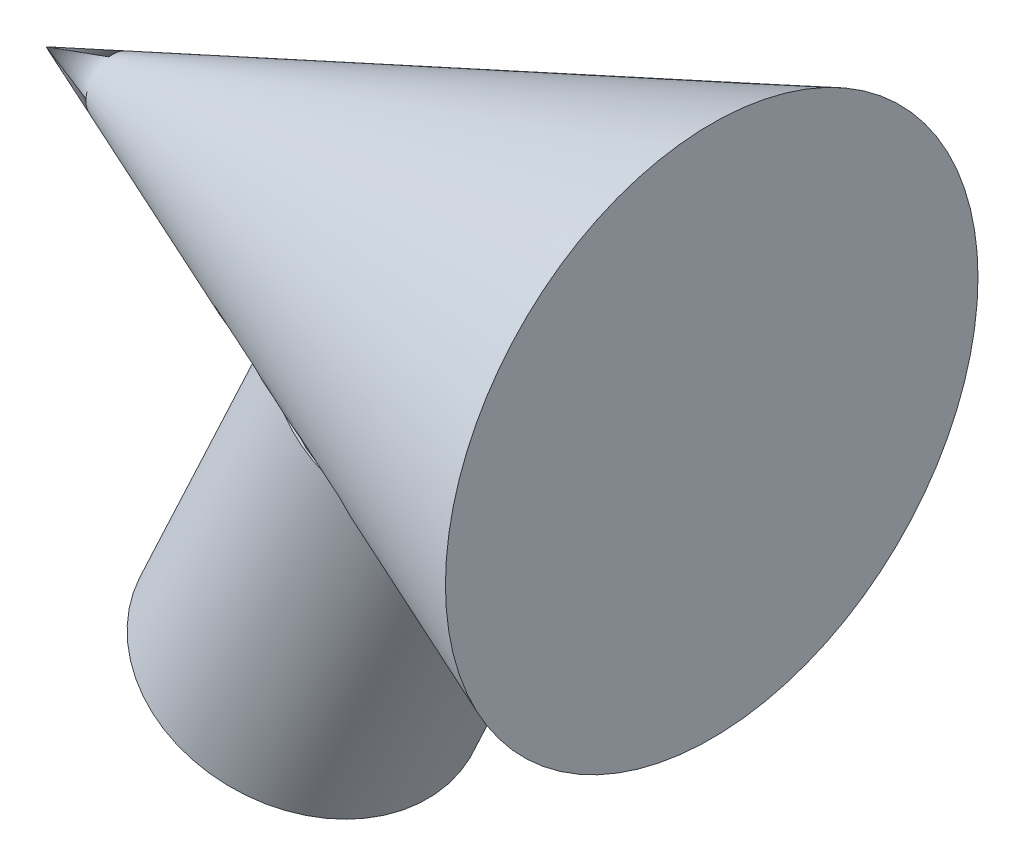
ISO-10303-21;
HEADER;
FILE_DESCRIPTION(('STEP AP214'),'2;1');
FILE_NAME('part.step','',(''),(''),'','','');
FILE_SCHEMA(('AUTOMOTIVE_DESIGN { 1 0 10303 214 1 1 1 1 }'));
ENDSEC;
DATA;
#1=APPLICATION_CONTEXT('core data for automotive mechanical design processes');
#2=APPLICATION_PROTOCOL_DEFINITION('international standard','automotive_design',2000,#1);
#3=PRODUCT_CONTEXT('',#1,'mechanical');
#4=PRODUCT('Part','Part','',(#3));
#5=PRODUCT_RELATED_PRODUCT_CATEGORY('part','',(#4));
#6=PRODUCT_DEFINITION_FORMATION('','',#4);
#7=PRODUCT_DEFINITION_CONTEXT('part definition',#1,'design');
#8=PRODUCT_DEFINITION('design','',#6,#7);
#9=PRODUCT_DEFINITION_SHAPE('','',#8);
#10=(LENGTH_UNIT() NAMED_UNIT(*) SI_UNIT(.MILLI.,.METRE.));
#11=(NAMED_UNIT(*) PLANE_ANGLE_UNIT() SI_UNIT($,.RADIAN.));
#12=(NAMED_UNIT(*) SI_UNIT($,.STERADIAN.) SOLID_ANGLE_UNIT());
#13=UNCERTAINTY_MEASURE_WITH_UNIT(LENGTH_MEASURE(1.E-05),#10,'distance_accuracy_value','');
#14=(GEOMETRIC_REPRESENTATION_CONTEXT(3) GLOBAL_UNCERTAINTY_ASSIGNED_CONTEXT((#13)) GLOBAL_UNIT_ASSIGNED_CONTEXT((#10,
#11,#12)) REPRESENTATION_CONTEXT('',''));
#15=CARTESIAN_POINT('',(0.,0.,0.));
#16=DIRECTION('',(0.,0.,1.));
#17=DIRECTION('',(1.,0.,0.));
#18=AXIS2_PLACEMENT_3D('',#15,#16,#17);
#19=CARTESIAN_POINT('',(-6.21617647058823,0.,0.));
#20=DIRECTION('',(1.,0.,0.));
#21=DIRECTION('',(0.,0.,-1.));
#22=AXIS2_PLACEMENT_3D('',#19,#20,#21);
#23=CONICAL_SURFACE('',#22,20.,0.380506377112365);
#24=CARTESIAN_POINT('',(-42.2497376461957,-0.877096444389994,5.51729353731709));
#25=CARTESIAN_POINT('',(-41.9433547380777,-0.972799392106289,5.62615306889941));
#26=CARTESIAN_POINT('',(-41.6366029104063,-1.06905452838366,5.73348200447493));
#27=CARTESIAN_POINT('',(-41.0225020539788,-1.26276669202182,5.9453029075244));
#28=CARTESIAN_POINT('',(-40.7151530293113,-1.36022371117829,6.04979489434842));
#29=CARTESIAN_POINT('',(-40.1000045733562,-1.55643515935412,6.25616413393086));
#30=CARTESIAN_POINT('',(-39.7922051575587,-1.65518954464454,6.35804147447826));
#31=CARTESIAN_POINT('',(-39.1762555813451,-1.85413580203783,6.55930223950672));
#32=CARTESIAN_POINT('',(-38.8681054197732,-1.95432767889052,6.65868565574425));
#33=CARTESIAN_POINT('',(-37.9401515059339,-2.25831874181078,6.95419767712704));
#34=CARTESIAN_POINT('',(-37.3199628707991,-2.46454246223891,7.14664409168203));
#35=CARTESIAN_POINT('',(-36.0792390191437,-2.88515558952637,7.52150615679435));
#36=CARTESIAN_POINT('',(-35.4587037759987,-3.09954574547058,7.70392088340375));
#37=CARTESIAN_POINT('',(-34.4274011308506,-3.46465556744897,7.99775584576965));
#38=CARTESIAN_POINT('',(-34.016505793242,-3.61244912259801,8.11236206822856));
#39=CARTESIAN_POINT('',(-33.1951400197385,-3.91340604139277,8.33596552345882));
#40=CARTESIAN_POINT('',(-32.7846695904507,-4.0665694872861,8.44496267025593));
#41=CARTESIAN_POINT('',(-31.9644348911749,-4.37908495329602,8.65654809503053));
#42=CARTESIAN_POINT('',(-31.5546706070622,-4.53843684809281,8.75913650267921));
#43=CARTESIAN_POINT('',(-30.7361528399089,-4.86412704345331,8.95694289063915));
#44=CARTESIAN_POINT('',(-30.3273993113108,-5.03046502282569,9.0521612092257));
#45=CARTESIAN_POINT('',(-29.5121156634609,-5.37042039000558,9.23397122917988));
#46=CARTESIAN_POINT('',(-29.1055826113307,-5.5440205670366,9.32058184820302));
#47=CARTESIAN_POINT('',(-28.2941237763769,-5.89926220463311,9.48436508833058));
#48=CARTESIAN_POINT('',(-27.8891979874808,-6.08090363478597,9.56153774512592));
#49=CARTESIAN_POINT('',(-27.0812528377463,-6.45228341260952,9.70549247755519));
#50=CARTESIAN_POINT('',(-26.6782333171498,-6.64202106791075,9.77227543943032));
#51=CARTESIAN_POINT('',(-25.8742610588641,-7.02930766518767,9.89471122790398));
#52=CARTESIAN_POINT('',(-25.47330831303,-7.22685657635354,9.95036409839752));
#53=CARTESIAN_POINT('',(-24.6973603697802,-7.61717998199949,10.0470710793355));
#54=CARTESIAN_POINT('',(-24.3222399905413,-7.80953933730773,10.0887967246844));
#55=CARTESIAN_POINT('',(-23.5739297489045,-8.19993551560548,10.1617278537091));
#56=CARTESIAN_POINT('',(-23.2007399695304,-8.39797258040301,10.1929328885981));
#57=CARTESIAN_POINT('',(-22.0839499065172,-8.99948565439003,10.270604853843));
#58=CARTESIAN_POINT('',(-21.3431522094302,-9.41035172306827,10.3011257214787));
#59=CARTESIAN_POINT('',(-19.867941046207,-10.24611431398,10.3196937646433));
#60=CARTESIAN_POINT('',(-19.1335361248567,-10.6710267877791,10.3076908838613));
#61=CARTESIAN_POINT('',(-17.671759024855,-11.5293588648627,10.2411576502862));
#62=CARTESIAN_POINT('',(-16.9443856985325,-11.962777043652,10.1866343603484));
#63=CARTESIAN_POINT('',(-15.8627835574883,-12.6139521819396,10.0726862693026));
#64=CARTESIAN_POINT('',(-15.5057340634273,-12.830012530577,10.029661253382));
#65=CARTESIAN_POINT('',(-14.7935762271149,-13.2628272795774,9.93274295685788));
#66=CARTESIAN_POINT('',(-14.4384676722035,-13.4795815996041,9.87885089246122));
#67=CARTESIAN_POINT('',(-13.7310098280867,-13.9129820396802,9.76000359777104));
#68=CARTESIAN_POINT('',(-13.3786565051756,-14.1296275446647,9.69507017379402));
#69=CARTESIAN_POINT('',(-12.6761898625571,-14.5628853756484,9.55360471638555));
#70=CARTESIAN_POINT('',(-12.3260769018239,-14.7794976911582,9.47707087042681));
#71=CARTESIAN_POINT('',(-11.9772293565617,-14.9958858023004,9.39451540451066));
#72=B_SPLINE_CURVE_WITH_KNOTS('',3,(#24,#25,#26,#27,#28,#29,#30,#31,#32,#33,#34,#35,#36,#37,#38,
#39,#40,#41,#42,#43,#44,#45,#46,#47,#48,#49,#50,#51,#52,#53,#54,#55,#56,#57,#58,#59,#60,#61,#62,
#63,#64,#65,#66,#67,#68,#69,#70,#71),.UNSPECIFIED.,.F.,.F.,(4,2,2,2,2,2,2,2,2,2,2,2,2,2,2,2,2,2,
2,2,2,2,2,4),(0.,1.01681090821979,2.03361487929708,3.0503846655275,4.06715781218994,
6.11100680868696,8.15504373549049,9.50935637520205,10.8636897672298,12.2179957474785,
13.5722395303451,14.9234379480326,16.274631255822,17.6257092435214,18.9767819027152,
20.247476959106,21.5182262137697,24.0598035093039,26.604373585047,29.1485210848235,
30.407037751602,31.6654136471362,32.9213325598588,34.1774479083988),.UNSPECIFIED.);
#73=CARTESIAN_POINT('',(-29.0207850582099,-5.58204793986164,9.33675698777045));
#74=VERTEX_POINT('',#73);
#75=CARTESIAN_POINT('',(-25.2223328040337,-7.35329531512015,9.98138183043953));
#76=VERTEX_POINT('',#75);
#77=EDGE_CURVE('E72',#74,#76,#72,.T.);
#78=ORIENTED_EDGE('',*,*,#77,.T.);
#79=CARTESIAN_POINT('',(-32.9068787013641,-5.93872036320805,-7.18772136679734));
#80=CARTESIAN_POINT('',(-33.1960403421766,-6.02248240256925,-6.96847775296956));
#81=CARTESIAN_POINT('',(-33.4758868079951,-6.11324403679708,-6.73957839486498));
#82=CARTESIAN_POINT('',(-34.0152338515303,-6.30174101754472,-6.26128479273));
#83=CARTESIAN_POINT('',(-34.2747234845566,-6.39948006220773,-6.01187966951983));
#84=CARTESIAN_POINT('',(-34.7693277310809,-6.59539535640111,-5.49204880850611));
#85=CARTESIAN_POINT('',(-35.00453824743,-6.69356815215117,-5.22171378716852));
#86=CARTESIAN_POINT('',(-35.447176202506,-6.88484908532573,-4.65788268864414));
#87=CARTESIAN_POINT('',(-35.6546321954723,-6.97796236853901,-4.3644109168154));
#88=CARTESIAN_POINT('',(-36.0543914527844,-7.16173387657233,-3.72336626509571));
#89=CARTESIAN_POINT('',(-36.2433205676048,-7.2512954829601,-3.37330462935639));
#90=CARTESIAN_POINT('',(-36.4883732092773,-7.36936650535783,-2.82769676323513));
#91=CARTESIAN_POINT('',(-36.5636708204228,-7.40601342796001,-2.64239580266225));
#92=CARTESIAN_POINT('',(-36.7000872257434,-7.47285231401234,-2.26555350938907));
#93=CARTESIAN_POINT('',(-36.761212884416,-7.50304740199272,-2.07401524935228));
#94=CARTESIAN_POINT('',(-36.8685311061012,-7.55631200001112,-1.68344305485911));
#95=CARTESIAN_POINT('',(-36.9145479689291,-7.579297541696,-1.48434904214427));
#96=CARTESIAN_POINT('',(-36.989468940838,-7.61682913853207,-1.08215875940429));
#97=CARTESIAN_POINT('',(-37.0183734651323,-7.63137539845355,-0.879062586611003));
#98=CARTESIAN_POINT('',(-37.0581990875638,-7.65143919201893,-0.470796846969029));
#99=CARTESIAN_POINT('',(-37.0691322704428,-7.65696279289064,-0.265628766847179));
#100=CARTESIAN_POINT('',(-37.0727064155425,-7.65876707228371,0.144898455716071));
#101=CARTESIAN_POINT('',(-37.0653491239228,-7.65504863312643,0.350257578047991));
#102=CARTESIAN_POINT('',(-37.0346995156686,-7.63959745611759,0.732781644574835));
#103=CARTESIAN_POINT('',(-37.0135818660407,-7.62895873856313,0.910170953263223));
#104=CARTESIAN_POINT('',(-36.9581438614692,-7.60112480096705,1.26232316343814));
#105=CARTESIAN_POINT('',(-36.9238250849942,-7.58393036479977,1.43708637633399));
#106=CARTESIAN_POINT('',(-36.8426983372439,-7.54347632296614,1.78300469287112));
#107=CARTESIAN_POINT('',(-36.7958870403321,-7.5202151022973,1.95415882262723));
#108=CARTESIAN_POINT('',(-36.6906608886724,-7.46824707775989,2.29202981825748));
#109=CARTESIAN_POINT('',(-36.6322431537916,-7.43953892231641,2.45874557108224));
#110=CARTESIAN_POINT('',(-36.4800203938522,-7.36529813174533,2.85086846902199));
#111=CARTESIAN_POINT('',(-36.3812794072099,-7.3175593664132,3.07395075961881));
#112=CARTESIAN_POINT('',(-36.1658517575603,-7.21484561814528,3.50952491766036));
#113=CARTESIAN_POINT('',(-36.0491582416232,-7.15986787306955,3.72201269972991));
#114=CARTESIAN_POINT('',(-35.7998474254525,-7.04443918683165,4.13667379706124));
#115=CARTESIAN_POINT('',(-35.667186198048,-6.98397326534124,4.33881637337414));
#116=CARTESIAN_POINT('',(-35.3882469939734,-6.85956320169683,4.73225942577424));
#117=CARTESIAN_POINT('',(-35.2419694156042,-6.79561916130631,4.92356021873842));
#118=CARTESIAN_POINT('',(-34.8596147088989,-6.63289626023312,5.3908568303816));
#119=CARTESIAN_POINT('',(-34.6158419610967,-6.53301179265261,5.66018694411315));
#120=CARTESIAN_POINT('',(-34.105061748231,-6.33533190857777,6.17688437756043));
#121=CARTESIAN_POINT('',(-33.8380367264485,-6.23753814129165,6.42423481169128));
#122=CARTESIAN_POINT('',(-33.2836106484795,-6.05057632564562,6.8983718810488));
#123=CARTESIAN_POINT('',(-32.9962134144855,-5.96140666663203,7.12516235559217));
#124=CARTESIAN_POINT('',(-32.4028100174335,-5.79928321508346,7.55910225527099));
#125=CARTESIAN_POINT('',(-32.0968193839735,-5.72631612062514,7.76626771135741));
#126=CARTESIAN_POINT('',(-31.6038889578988,-5.63207924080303,8.07530914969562));
#127=CARTESIAN_POINT('',(-31.4228057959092,-5.60210786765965,8.18391606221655));
#128=CARTESIAN_POINT('',(-31.055434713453,-5.55245581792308,8.39443864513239));
#129=CARTESIAN_POINT('',(-30.8691484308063,-5.53277194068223,8.4963563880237));
#130=CARTESIAN_POINT('',(-30.4923599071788,-5.50592349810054,8.69271542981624));
#131=CARTESIAN_POINT('',(-30.3018697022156,-5.49872695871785,8.78717523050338));
#132=CARTESIAN_POINT('',(-29.9170893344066,-5.49900748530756,8.96804928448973));
#133=CARTESIAN_POINT('',(-29.7227999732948,-5.50648148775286,9.0544652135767));
#134=CARTESIAN_POINT('',(-29.3634362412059,-5.5355484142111,9.20485864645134));
#135=CARTESIAN_POINT('',(-29.1987341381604,-5.55465490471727,9.27020225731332));
#136=CARTESIAN_POINT('',(-28.8685878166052,-5.60545367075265,9.39369421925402));
#137=CARTESIAN_POINT('',(-28.7031437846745,-5.63714294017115,9.45184428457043));
#138=CARTESIAN_POINT('',(-28.3727144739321,-5.71352924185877,9.56017511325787));
#139=CARTESIAN_POINT('',(-28.2077290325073,-5.75822084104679,9.61035919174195));
#140=CARTESIAN_POINT('',(-27.8793594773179,-5.86050300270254,9.70211004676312));
#141=CARTESIAN_POINT('',(-27.7159753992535,-5.91809385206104,9.74367663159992));
#142=CARTESIAN_POINT('',(-27.3920815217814,-6.04545161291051,9.81765170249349));
#143=CARTESIAN_POINT('',(-27.2315693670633,-6.11520799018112,9.85006804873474));
#144=CARTESIAN_POINT('',(-26.9141899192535,-6.26581903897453,9.90550052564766));
#145=CARTESIAN_POINT('',(-26.7573226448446,-6.34667376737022,9.9285166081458));
#146=CARTESIAN_POINT('',(-26.447676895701,-6.51820420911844,9.96509083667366));
#147=CARTESIAN_POINT('',(-26.2949038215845,-6.60889216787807,9.97863702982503));
#148=CARTESIAN_POINT('',(-25.9939933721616,-6.79852764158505,9.99631571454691));
#149=CARTESIAN_POINT('',(-25.845857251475,-6.89747736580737,10.0004456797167));
#150=CARTESIAN_POINT('',(-25.496483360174,-7.1428270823,9.99928644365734));
#151=CARTESIAN_POINT('',(-25.297523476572,-7.29246384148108,9.98960462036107));
#152=CARTESIAN_POINT('',(-24.9088852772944,-7.60135691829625,9.95293794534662));
#153=CARTESIAN_POINT('',(-24.719210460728,-7.76061681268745,9.92594662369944));
#154=CARTESIAN_POINT('',(-24.3484461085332,-8.08595719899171,9.85534887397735));
#155=CARTESIAN_POINT('',(-24.1673728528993,-8.25204959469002,9.81171224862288));
#156=CARTESIAN_POINT('',(-23.8137223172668,-8.58822031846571,9.70852468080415));
#157=CARTESIAN_POINT('',(-23.6411450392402,-8.75829864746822,9.64897373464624));
#158=CARTESIAN_POINT('',(-23.2568425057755,-9.148209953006,9.49573058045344));
#159=CARTESIAN_POINT('',(-23.047672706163,-9.36865050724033,9.39714779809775));
#160=CARTESIAN_POINT('',(-22.6418000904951,-9.80895159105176,9.17588388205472));
#161=CARTESIAN_POINT('',(-22.4451003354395,-10.0288119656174,9.05319686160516));
#162=CARTESIAN_POINT('',(-22.0638445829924,-10.4648294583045,8.78454286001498));
#163=CARTESIAN_POINT('',(-21.8792892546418,-10.6809863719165,8.63857459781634));
#164=CARTESIAN_POINT('',(-21.5223257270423,-11.1067883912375,8.32408192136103));
#165=CARTESIAN_POINT('',(-21.3499165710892,-11.3164340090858,8.15555928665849));
#166=CARTESIAN_POINT('',(-21.0166597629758,-11.7276689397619,7.79572308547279));
#167=CARTESIAN_POINT('',(-20.8558744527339,-11.9292125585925,7.60429942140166));
#168=CARTESIAN_POINT('',(-20.5473700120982,-12.3205547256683,7.2001008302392));
#169=CARTESIAN_POINT('',(-20.3996501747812,-12.5103539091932,6.98732705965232));
#170=CARTESIAN_POINT('',(-20.1180758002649,-12.8756263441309,6.54138973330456));
#171=CARTESIAN_POINT('',(-19.9842171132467,-13.0511038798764,6.30823231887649));
#172=CARTESIAN_POINT('',(-19.7312750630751,-13.3852494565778,5.8226339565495));
#173=CARTESIAN_POINT('',(-19.6121905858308,-13.5439187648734,5.57019446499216));
#174=CARTESIAN_POINT('',(-19.3951518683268,-13.834868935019,5.05991978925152));
#175=CARTESIAN_POINT('',(-19.2964635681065,-13.9680441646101,4.80290765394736));
#176=CARTESIAN_POINT('',(-19.1144886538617,-14.2147331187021,4.27442162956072));
#177=CARTESIAN_POINT('',(-19.0311993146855,-14.3282503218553,4.00295031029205));
#178=CARTESIAN_POINT('',(-18.8810536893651,-14.5335935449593,3.44776883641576));
#179=CARTESIAN_POINT('',(-18.814184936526,-14.6254360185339,3.16406816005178));
#180=CARTESIAN_POINT('',(-18.6977143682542,-14.7857942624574,2.58670857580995));
#181=CARTESIAN_POINT('',(-18.648109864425,-14.854313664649,2.29305122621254));
#182=CARTESIAN_POINT('',(-18.5721535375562,-14.9593910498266,1.73706922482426));
#183=CARTESIAN_POINT('',(-18.5436248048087,-14.9989356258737,1.47560126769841));
#184=CARTESIAN_POINT('',(-18.5005561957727,-15.058674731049,0.949330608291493));
#185=CARTESIAN_POINT('',(-18.4860149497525,-15.078871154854,0.684528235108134));
#186=CARTESIAN_POINT('',(-18.4711065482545,-15.0995778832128,0.153865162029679));
#187=CARTESIAN_POINT('',(-18.4707337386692,-15.1000960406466,-0.111995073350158));
#188=CARTESIAN_POINT('',(-18.4841527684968,-15.0814572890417,-0.642663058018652));
#189=CARTESIAN_POINT('',(-18.497944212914,-15.0623009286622,-0.907470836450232));
#190=CARTESIAN_POINT('',(-18.5380154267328,-15.0067137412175,-1.41487640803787));
#191=CARTESIAN_POINT('',(-18.5633241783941,-14.971626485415,-1.65770015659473));
#192=CARTESIAN_POINT('',(-18.6257190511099,-14.8852751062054,-2.13892102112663));
#193=CARTESIAN_POINT('',(-18.6628054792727,-14.8340105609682,-2.37731802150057));
#194=CARTESIAN_POINT('',(-18.7483852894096,-14.7159903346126,-2.84813993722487));
#195=CARTESIAN_POINT('',(-18.7968785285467,-14.6492348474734,-3.08056492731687));
#196=CARTESIAN_POINT('',(-18.9048251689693,-14.5010773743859,-3.53808200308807));
#197=CARTESIAN_POINT('',(-18.9642790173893,-14.4196747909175,-3.76317378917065));
#198=CARTESIAN_POINT('',(-19.0956956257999,-14.2403982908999,-4.211810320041));
#199=CARTESIAN_POINT('',(-19.1679948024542,-14.142084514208,-4.43508050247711));
#200=CARTESIAN_POINT('',(-19.3231748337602,-13.9320281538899,-4.87147482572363));
#201=CARTESIAN_POINT('',(-19.4060592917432,-13.8202809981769,-5.08459547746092));
#202=CARTESIAN_POINT('',(-19.5818129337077,-13.5846100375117,-5.49966769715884));
#203=CARTESIAN_POINT('',(-19.6746817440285,-13.460686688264,-5.70161968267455));
#204=CARTESIAN_POINT('',(-19.8698647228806,-13.2019042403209,-6.09360893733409));
#205=CARTESIAN_POINT('',(-19.9721798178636,-13.0670440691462,-6.28364503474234));
#206=CARTESIAN_POINT('',(-20.1971091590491,-12.7727981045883,-6.67070567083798));
#207=CARTESIAN_POINT('',(-20.3207250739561,-12.6123291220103,-6.8663256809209));
#208=CARTESIAN_POINT('',(-20.5782733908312,-12.2813264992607,-7.24144658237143));
#209=CARTESIAN_POINT('',(-20.7122028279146,-12.1107957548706,-7.42095207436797));
#210=CARTESIAN_POINT('',(-20.9901297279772,-11.7611125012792,-7.76357036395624));
#211=CARTESIAN_POINT('',(-21.1341397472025,-11.5819493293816,-7.92666207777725));
#212=CARTESIAN_POINT('',(-21.4317128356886,-11.2169966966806,-8.23565581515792));
#213=CARTESIAN_POINT('',(-21.5852733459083,-11.0312090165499,-8.38156241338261));
#214=CARTESIAN_POINT('',(-21.9207115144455,-10.6322909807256,-8.67213368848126));
#215=CARTESIAN_POINT('',(-22.1037825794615,-10.4185413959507,-8.81457671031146));
#216=CARTESIAN_POINT('',(-22.4818246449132,-9.98756508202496,-9.07675535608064));
#217=CARTESIAN_POINT('',(-22.6767981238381,-9.77033763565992,-9.1964862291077));
#218=CARTESIAN_POINT('',(-23.0788732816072,-9.3355668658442,-9.41236088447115));
#219=CARTESIAN_POINT('',(-23.2859694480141,-9.11802372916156,-9.50851528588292));
#220=CARTESIAN_POINT('',(-23.7129787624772,-8.68613563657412,-9.67629073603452));
#221=CARTESIAN_POINT('',(-23.9328865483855,-8.4717893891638,-9.74792196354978));
#222=CARTESIAN_POINT('',(-24.3167602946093,-8.11538382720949,-9.84739705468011));
#223=CARTESIAN_POINT('',(-24.4771696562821,-7.97133783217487,-9.88193245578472));
#224=CARTESIAN_POINT('',(-24.8048889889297,-7.68871195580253,-9.93816814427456));
#225=CARTESIAN_POINT('',(-24.9721971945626,-7.55013069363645,-9.95987169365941));
#226=CARTESIAN_POINT('',(-25.3137106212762,-7.28073991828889,-9.98991977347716));
#227=CARTESIAN_POINT('',(-25.4879043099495,-7.14991825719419,-9.99828574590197));
#228=CARTESIAN_POINT('',(-25.8434952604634,-6.89825853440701,-10.0012384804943));
#229=CARTESIAN_POINT('',(-26.0248910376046,-6.77741843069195,-9.99582806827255));
#230=CARTESIAN_POINT('',(-26.361327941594,-6.56901203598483,-9.97312667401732));
#231=CARTESIAN_POINT('',(-26.5152402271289,-6.47937048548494,-9.95814787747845));
#232=CARTESIAN_POINT('',(-26.8272805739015,-6.31011836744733,-9.91862995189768));
#233=CARTESIAN_POINT('',(-26.9854076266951,-6.23050542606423,-9.89409309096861));
#234=CARTESIAN_POINT('',(-27.305043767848,-6.08274408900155,-9.83560028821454));
#235=CARTESIAN_POINT('',(-27.4665490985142,-6.01458364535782,-9.8016543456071));
#236=CARTESIAN_POINT('',(-27.7921435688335,-5.89068642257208,-9.72465952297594));
#237=CARTESIAN_POINT('',(-27.9562327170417,-5.83494968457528,-9.68161061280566));
#238=CARTESIAN_POINT('',(-28.2858433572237,-5.73648767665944,-9.58694905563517));
#239=CARTESIAN_POINT('',(-28.4513649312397,-5.6937631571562,-9.53533591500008));
#240=CARTESIAN_POINT('',(-28.7826042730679,-5.62135402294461,-9.42425200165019));
#241=CARTESIAN_POINT('',(-28.9483220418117,-5.59166947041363,-9.36478119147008));
#242=CARTESIAN_POINT('',(-29.2789511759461,-5.54479972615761,-9.23870129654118));
#243=CARTESIAN_POINT('',(-29.4438617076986,-5.5276255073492,-9.17208600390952));
#244=CARTESIAN_POINT('',(-29.7718002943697,-5.50486276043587,-9.03249566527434));
#245=CARTESIAN_POINT('',(-29.9348277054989,-5.49927808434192,-8.95951851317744));
#246=CARTESIAN_POINT('',(-30.3467033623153,-5.49828323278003,-8.76637929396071));
#247=CARTESIAN_POINT('',(-30.5937159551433,-5.51010956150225,-8.64224263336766));
#248=CARTESIAN_POINT('',(-31.0796049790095,-5.55370920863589,-8.38211071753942));
#249=CARTESIAN_POINT('',(-31.3184760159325,-5.58549549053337,-8.24610780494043));
#250=CARTESIAN_POINT('',(-31.7881276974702,-5.66451032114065,-7.96259650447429));
#251=CARTESIAN_POINT('',(-32.0188652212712,-5.71181048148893,-7.8150372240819));
#252=CARTESIAN_POINT('',(-32.4704206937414,-5.81768395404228,-7.50934812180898));
#253=CARTESIAN_POINT('',(-32.691239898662,-5.87625583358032,-7.35121964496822));
#254=CARTESIAN_POINT('',(-32.9068787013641,-5.93872036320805,-7.18772136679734));
#255=B_SPLINE_CURVE_WITH_KNOTS('',3,(#79,#80,#81,#82,#83,#84,#85,#86,#87,#88,#89,#90,#91,#92,
#93,#94,#95,#96,#97,#98,#99,#100,#101,#102,#103,#104,#105,#106,#107,#108,#109,#110,#111,#112,
#113,#114,#115,#116,#117,#118,#119,#120,#121,#122,#123,#124,#125,#126,#127,#128,#129,#130,#131,
#132,#133,#134,#135,#136,#137,#138,#139,#140,#141,#142,#143,#144,#145,#146,#147,#148,#149,#150,
#151,#152,#153,#154,#155,#156,#157,#158,#159,#160,#161,#162,#163,#164,#165,#166,#167,#168,#169,
#170,#171,#172,#173,#174,#175,#176,#177,#178,#179,#180,#181,#182,#183,#184,#185,#186,#187,#188,
#189,#190,#191,#192,#193,#194,#195,#196,#197,#198,#199,#200,#201,#202,#203,#204,#205,#206,#207,
#208,#209,#210,#211,#212,#213,#214,#215,#216,#217,#218,#219,#220,#221,#222,#223,#224,#225,#226,
#227,#228,#229,#230,#231,#232,#233,#234,#235,#236,#237,#238,#239,#240,#241,#242,#243,#244,#245,
#246,#247,#248,#249,#250,#251,#252,#253,#254),.UNSPECIFIED.,.T.,.F.,(4,2,2,2,2,2,2,2,2,2,2,2,2,
2,2,2,2,2,2,2,2,2,2,2,2,2,2,2,2,2,2,2,2,2,2,2,2,2,2,2,2,2,2,2,2,2,2,2,2,2,2,2,2,2,2,2,2,2,2,2,2,
2,2,2,2,2,2,2,2,2,2,2,2,2,2,2,2,2,2,2,2,2,2,2,2,2,2,4),(0.,1.11703651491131,2.23466953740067,
3.3477038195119,4.45958404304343,5.67835783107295,6.2878222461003,6.89699083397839,
7.51301132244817,8.12901686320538,8.74460800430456,9.3601403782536,9.89638588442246,
10.432567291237,10.9688915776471,11.5053491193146,12.2499450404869,12.9948259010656,
13.7418048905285,14.488762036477,15.6173617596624,16.7468211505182,17.8760691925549,
19.0043866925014,19.64386632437,20.2831468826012,20.9207881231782,21.558296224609,
22.092411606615,22.6263994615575,23.1601645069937,23.693941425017,24.2272584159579,
24.7605781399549,25.2945698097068,25.8287047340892,26.5749876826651,27.3215497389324,
28.0694726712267,28.8173957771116,29.7745659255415,30.7319701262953,31.6894270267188,
32.6468084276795,33.6089928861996,34.5711252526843,35.5329687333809,36.4947396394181,
37.4109186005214,38.3269352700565,39.2422543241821,40.1574307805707,40.9543055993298,
41.7511023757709,42.5475811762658,43.3440377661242,44.0831294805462,44.8222404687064,
45.5613422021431,46.3004740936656,47.0630050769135,47.8257963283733,48.5885590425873,
49.3513966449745,50.1953250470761,51.0390117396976,51.8837686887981,52.7283002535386,
53.6735113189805,54.6189198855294,55.5639018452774,56.5084910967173,57.1630359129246,
57.8174142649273,58.4707395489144,59.123930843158,59.6596239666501,60.1951900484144,
60.7301891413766,61.2651900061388,61.8002217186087,62.3352559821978,62.8707589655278,
63.40643990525,64.235140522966,65.064379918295,65.8975022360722,66.7305187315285),.UNSPECIFIED.);
#256=CARTESIAN_POINT('',(-25.2223328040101,-7.35329531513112,-9.98138183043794));
#257=VERTEX_POINT('',#256);
#258=EDGE_CURVE('E11',#76,#257,#255,.T.);
#259=ORIENTED_EDGE('',*,*,#258,.T.);
#260=CARTESIAN_POINT('',(-11.9772293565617,-14.9958858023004,-9.39451540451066));
#261=CARTESIAN_POINT('',(-12.3735283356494,-14.7500680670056,-9.48828748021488));
#262=CARTESIAN_POINT('',(-12.771452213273,-14.5039600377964,-9.57430454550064));
#263=CARTESIAN_POINT('',(-13.5701902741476,-14.0117433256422,-9.73145443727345));
#264=CARTESIAN_POINT('',(-13.9710042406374,-13.7656346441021,-9.80258836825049));
#265=CARTESIAN_POINT('',(-14.7753468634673,-13.2738835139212,-9.93063139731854));
#266=CARTESIAN_POINT('',(-15.178876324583,-13.0282412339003,-9.98753606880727));
#267=CARTESIAN_POINT('',(-15.988331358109,-12.5380792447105,-10.0874999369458));
#268=CARTESIAN_POINT('',(-16.3942569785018,-12.2935595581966,-10.1305588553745));
#269=CARTESIAN_POINT('',(-17.208270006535,-11.8063393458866,-10.2030956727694));
#270=CARTESIAN_POINT('',(-17.6163568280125,-11.5636383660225,-10.2325770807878));
#271=CARTESIAN_POINT('',(-18.434741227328,-11.0807100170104,-10.2781240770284));
#272=CARTESIAN_POINT('',(-18.8450389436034,-10.8404828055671,-10.294188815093));
#273=CARTESIAN_POINT('',(-20.0789890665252,-10.1248441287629,-10.3223211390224));
#274=CARTESIAN_POINT('',(-20.9060696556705,-9.6542520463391,-10.3143597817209));
#275=CARTESIAN_POINT('',(-22.0136415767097,-9.04147777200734,-10.2680649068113));
#276=CARTESIAN_POINT('',(-22.2901520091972,-8.88992839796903,-10.2535754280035));
#277=CARTESIAN_POINT('',(-22.8442128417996,-8.58946423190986,-10.2186961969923));
#278=CARTESIAN_POINT('',(-23.1217631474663,-8.44054920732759,-10.1983069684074));
#279=CARTESIAN_POINT('',(-23.6776998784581,-8.14578631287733,-10.1516726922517));
#280=CARTESIAN_POINT('',(-23.956085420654,-7.99993600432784,-10.1254325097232));
#281=CARTESIAN_POINT('',(-24.5139487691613,-7.711470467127,-10.0671458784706));
#282=CARTESIAN_POINT('',(-24.7934266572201,-7.56885548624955,-10.035098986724));
#283=CARTESIAN_POINT('',(-25.4731464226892,-7.22693869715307,-9.95038324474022));
#284=CARTESIAN_POINT('',(-25.8739438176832,-7.02946415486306,-9.89475497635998));
#285=CARTESIAN_POINT('',(-26.6776218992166,-6.64231193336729,-9.7723731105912));
#286=CARTESIAN_POINT('',(-27.08050270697,-6.45263471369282,-9.70561885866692));
#287=CARTESIAN_POINT('',(-27.888222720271,-6.08134544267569,-9.56171877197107));
#288=CARTESIAN_POINT('',(-28.2930623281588,-5.89973513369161,-9.48457070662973));
#289=CARTESIAN_POINT('',(-29.1043422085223,-5.54455536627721,-9.3208408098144));
#290=CARTESIAN_POINT('',(-29.5107824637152,-5.37098582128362,-9.23425907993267));
#291=CARTESIAN_POINT('',(-30.3260987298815,-5.03099782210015,-9.05246069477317));
#292=CARTESIAN_POINT('',(-30.7349783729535,-4.86460067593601,-8.95722061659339));
#293=CARTESIAN_POINT('',(-31.5537493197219,-4.53879713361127,-8.75936523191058));
#294=CARTESIAN_POINT('',(-31.9636406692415,-4.37939106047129,-8.65674958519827));
#295=CARTESIAN_POINT('',(-32.7841135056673,-4.06677786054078,-8.44510949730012));
#296=CARTESIAN_POINT('',(-33.1946949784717,-3.91357060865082,-8.33608518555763));
#297=CARTESIAN_POINT('',(-34.0162831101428,-3.61252921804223,-8.11242418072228));
#298=CARTESIAN_POINT('',(-34.4272897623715,-3.46469499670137,-7.99778757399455));
#299=CARTESIAN_POINT('',(-35.4588744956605,-3.0994853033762,-7.70387224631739));
#300=CARTESIAN_POINT('',(-36.0795805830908,-2.8850375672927,-7.52140577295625));
#301=CARTESIAN_POINT('',(-37.3206533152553,-2.46431062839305,-7.14643267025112));
#302=CARTESIAN_POINT('',(-37.9410199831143,-2.25803077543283,-6.95392684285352));
#303=CARTESIAN_POINT('',(-38.8690658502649,-1.95401476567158,-6.6583769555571));
#304=CARTESIAN_POINT('',(-39.1771304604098,-1.85385209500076,-6.55901859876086));
#305=CARTESIAN_POINT('',(-39.7929090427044,-1.65496332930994,-6.35780924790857));
#306=CARTESIAN_POINT('',(-40.1006230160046,-1.55623722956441,-6.25595826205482));
#307=CARTESIAN_POINT('',(-40.7155970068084,-1.36008276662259,-6.04964433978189));
#308=CARTESIAN_POINT('',(-41.022857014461,-1.26265443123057,-5.94518134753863));
#309=CARTESIAN_POINT('',(-41.636780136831,-1.06899891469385,-5.73342000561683));
#310=CARTESIAN_POINT('',(-41.9434432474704,-0.972771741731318,-5.62612163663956));
#311=CARTESIAN_POINT('',(-42.2497376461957,-0.877096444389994,-5.51729353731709));
#312=B_SPLINE_CURVE_WITH_KNOTS('',3,(#260,#261,#262,#263,#264,#265,#266,#267,#268,#269,#270,
#271,#272,#273,#274,#275,#276,#277,#278,#279,#280,#281,#282,#283,#284,#285,#286,#287,#288,#289,
#290,#291,#292,#293,#294,#295,#296,#297,#298,#299,#300,#301,#302,#303,#304,#305,#306,#307,#308,
#309,#310,#311),.UNSPECIFIED.,.F.,.F.,(4,2,2,2,2,2,2,2,2,2,2,2,2,2,2,2,2,2,2,2,2,2,2,2,2,4),(0.,
1.42694020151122,2.85377447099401,4.28105206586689,5.70835833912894,7.13529552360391,
8.56232312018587,11.4150763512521,12.3619895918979,13.30881881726,14.2548636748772,
15.2009807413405,16.5515208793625,17.9021404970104,19.2530504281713,20.6039458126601,
21.9586110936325,23.3133389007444,24.66803935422,26.0227189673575,28.0673184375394,
30.111754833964,31.128246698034,32.1447352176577,33.1612454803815,34.1777626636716),.UNSPECIFIED.);
#313=CARTESIAN_POINT('',(-29.02078505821,-5.58204793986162,-9.3367569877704));
#314=VERTEX_POINT('',#313);
#315=EDGE_CURVE('E35',#257,#314,#312,.T.);
#316=ORIENTED_EDGE('',*,*,#315,.T.);
#317=EDGE_CURVE('E45',#314,#74,#255,.T.);
#318=ORIENTED_EDGE('',*,*,#317,.T.);
#319=EDGE_LOOP('',(#78,#259,#316,#318));
#320=FACE_BOUND('',#319,.T.);
#321=CARTESIAN_POINT('',(-56.2161764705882,0.,0.));
#322=VERTEX_POINT('',#321);
#323=VERTEX_LOOP('',#322);
#324=FACE_BOUND('',#323,.T.);
#325=CARTESIAN_POINT('',(-6.21617647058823,0.,0.));
#326=DIRECTION('',(-1.,0.,0.));
#327=DIRECTION('',(0.,0.,1.));
#328=AXIS2_PLACEMENT_3D('',#325,#326,#327);
#329=CIRCLE('',#328,20.);
#330=CARTESIAN_POINT('',(-6.21617647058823,0.,20.));
#331=VERTEX_POINT('',#330);
#332=EDGE_CURVE('E74',#331,#331,#329,.T.);
#333=ORIENTED_EDGE('',*,*,#332,.T.);
#334=EDGE_LOOP('',(#333));
#335=FACE_BOUND('',#334,.T.);
#336=ADVANCED_FACE('F31',(#320,#324,#335),#23,.T.);
#337=CARTESIAN_POINT('',(-6.21617647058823,20.,0.));
#338=DIRECTION('',(-1.,0.,0.));
#339=DIRECTION('',(0.,0.,1.));
#340=AXIS2_PLACEMENT_3D('',#337,#338,#339);
#341=PLANE('',#340);
#342=ORIENTED_EDGE('',*,*,#332,.F.);
#343=EDGE_LOOP('',(#342));
#344=FACE_BOUND('',#343,.T.);
#345=ADVANCED_FACE('F86',(#344),#341,.F.);
#346=CARTESIAN_POINT('',(-25.1080889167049,-5.66507700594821,0.));
#347=DIRECTION('',(-0.422618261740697,-0.906307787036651,0.));
#348=DIRECTION('',(0.906307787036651,-0.422618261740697,0.));
#349=AXIS2_PLACEMENT_3D('',#346,#347,#348);
#350=CONICAL_SURFACE('',#349,0.,1.41425498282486);
#351=ORIENTED_EDGE('',*,*,#315,.F.);
#352=CARTESIAN_POINT('',(-25.775118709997,-7.09552701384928,0.));
#353=DIRECTION('',(0.422618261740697,0.906307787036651,0.));
#354=DIRECTION('',(-0.906307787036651,0.422618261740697,0.));
#355=AXIS2_PLACEMENT_3D('',#352,#353,#354);
#356=CIRCLE('',#355,10.);
#357=EDGE_CURVE('E66',#257,#314,#356,.T.);
#358=ORIENTED_EDGE('',*,*,#357,.T.);
#359=EDGE_LOOP('',(#351,#358));
#360=FACE_BOUND('',#359,.T.);
#361=ADVANCED_FACE('F83',(#360),#350,.T.);
#362=ORIENTED_EDGE('',*,*,#77,.F.);
#363=EDGE_CURVE('E52',#74,#76,#356,.T.);
#364=ORIENTED_EDGE('',*,*,#363,.T.);
#365=EDGE_LOOP('',(#362,#364));
#366=FACE_BOUND('',#365,.T.);
#367=ADVANCED_FACE('F71',(#366),#350,.T.);
#368=CARTESIAN_POINT('',(-25.6202208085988,-6.76334739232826,0.));
#369=DIRECTION('',(0.422618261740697,0.906307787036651,0.));
#370=DIRECTION('',(-0.906307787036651,0.422618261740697,0.));
#371=AXIS2_PLACEMENT_3D('',#368,#369,#370);
#372=CYLINDRICAL_SURFACE('',#371,10.);
#373=CARTESIAN_POINT('',(-36.628199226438,-30.3700332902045,0.));
#374=DIRECTION('',(0.422618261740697,0.906307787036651,0.));
#375=DIRECTION('',(-0.906307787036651,0.422618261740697,0.));
#376=AXIS2_PLACEMENT_3D('',#373,#374,#375);
#377=CIRCLE('',#376,10.);
#378=CARTESIAN_POINT('',(-45.6912770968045,-26.1438506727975,0.));
#379=VERTEX_POINT('',#378);
#380=EDGE_CURVE('E100',#379,#379,#377,.T.);
#381=ORIENTED_EDGE('',*,*,#380,.T.);
#382=EDGE_LOOP('',(#381));
#383=FACE_BOUND('',#382,.T.);
#384=ORIENTED_EDGE('',*,*,#258,.F.);
#385=ORIENTED_EDGE('',*,*,#363,.F.);
#386=ORIENTED_EDGE('',*,*,#317,.F.);
#387=ORIENTED_EDGE('',*,*,#357,.F.);
#388=EDGE_LOOP('',(#384,#385,#386,#387));
#389=FACE_BOUND('',#388,.T.);
#390=ADVANCED_FACE('F64',(#383,#389),#372,.T.);
#391=CARTESIAN_POINT('',(-45.6912770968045,-26.1438506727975,0.));
#392=DIRECTION('',(-0.422618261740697,-0.906307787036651,0.));
#393=DIRECTION('',(0.906307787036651,-0.422618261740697,0.));
#394=AXIS2_PLACEMENT_3D('',#391,#392,#393);
#395=PLANE('',#394);
#396=ORIENTED_EDGE('',*,*,#380,.F.);
#397=EDGE_LOOP('',(#396));
#398=FACE_BOUND('',#397,.T.);
#399=ADVANCED_FACE('F105',(#398),#395,.T.);
#400=CLOSED_SHELL('',(#336,#345,#361,#367,#390,#399));
#401=MANIFOLD_SOLID_BREP('B2',#400);
#402=ADVANCED_BREP_SHAPE_REPRESENTATION('',(#18,#401),#14);
#403=SHAPE_DEFINITION_REPRESENTATION(#9,#402);
ENDSEC;
END-ISO-10303-21;
